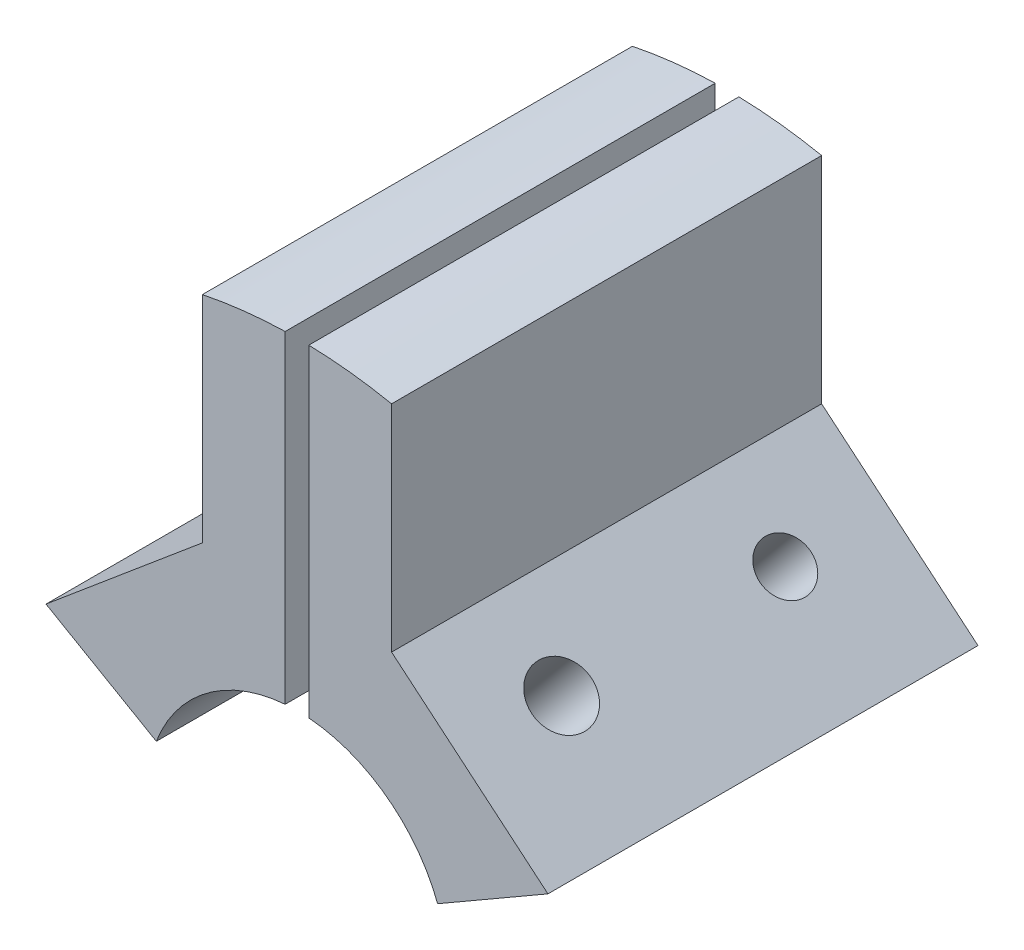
from build123d import *

# Parameters (mm, degrees)
SKETCH_1_W          = 2.75
SKETCH_1_H          = 28.136911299
EXTRUDE_1_DEPTH     = 25
SKETCH_2_W          = 2.75
SKETCH_2_H          = 4.7
CUT_EXTRUDE_1_DEPTH = 59.454793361
SKETCH_5_R          = 3
SKETCH_5_R_2        = 3.5
CUT_EXTRUDE_2_DEPTH = 64.148156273
SKETCH_6_R          = 3
SKETCH_6_R_2        = 3.5
CUT_EXTRUDE_3_DEPTH = 64.148156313


with BuildPart() as part:
    # Sketch 1 → Extrude 1 (new, symmetric)
    with BuildSketch(Plane.XY):
        with BuildLine():
            ThreePointArc((-1.375, 54.982809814), (-6.21163301, 54.648107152), (-11, 53.888774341))
            Line((-11, 53.888774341), (-11, 28.888774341))
            Line((-11, 28.888774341), (-29.178360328, 13.635318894))
            Line((-29.178360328, 13.635318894), (-16.353227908, 6.230725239))
            ThreePointArc((-16.353227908, 6.230725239), (-10.48892483, 14.008299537), (-1.375, 17.445898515))
            Line((-1.375, 17.445898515), (-1.375, 22.145898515))
            Line((-1.375, 22.145898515), (-1.375, 50.282809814))
            Line((-1.375, 50.282809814), (-1.375, 54.982809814))
        make_face()
        with BuildLine():
            ThreePointArc((11, 53.888774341), (6.21163301, 54.648107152), (1.375, 54.982809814))
            Line((1.375, 54.982809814), (1.375, 50.282809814))
            Line((1.375, 50.282809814), (1.375, 22.145898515))
            Line((1.375, 22.145898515), (1.375, 17.445898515))
            ThreePointArc((1.375, 17.445898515), (10.48892483, 14.008299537), (16.353227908, 6.230725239))
            Line((16.353227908, 6.230725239), (29.178360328, 13.635318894))
            Line((29.178360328, 13.635318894), (11, 28.888774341))
            Line((11, 28.888774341), (11, 53.888774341))
        make_face()
        with Locations((0, 36.214354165)):
            Rectangle(SKETCH_1_W, SKETCH_1_H)
    extrude(amount=EXTRUDE_1_DEPTH, both=True)

    # Sketch 2 → Cut-Extrude 1 (cut, through all)
    with BuildSketch(Plane(origin=(0, 50.282809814, 0), x_dir=(1, 0, 0), z_dir=(0, 1, 0))):
        with Locations((0, 22.65)):
            Rectangle(SKETCH_2_W, SKETCH_2_H)
        with Locations((0, -22.65)):
            Rectangle(SKETCH_2_W, SKETCH_2_H)
    extrude(amount=-CUT_EXTRUDE_1_DEPTH, mode=Mode.SUBTRACT)

    # Sketch 5 → Cut-Extrude 2 (cut, through all)
    with BuildSketch(Plane(origin=(-18.769879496, 22.369071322, 0), x_dir=(0.7660444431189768, 0.642787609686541, 0), z_dir=(-0.642787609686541, 0.7660444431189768, 0))):
        with Locations(Location((0, -13, 0), (0, 0, 180))):
            Circle(SKETCH_5_R)
        with Locations(Location((0, 13, 0), (0, 0, 180))):
            Circle(SKETCH_5_R_2)
    extrude(amount=-CUT_EXTRUDE_2_DEPTH, mode=Mode.SUBTRACT)

    # Sketch 6 → Cut-Extrude 3 (cut, through all)
    with BuildSketch(Plane(origin=(18.769879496, 22.369071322, 0), x_dir=(0.7660444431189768, -0.642787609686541, 0), z_dir=(0.642787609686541, 0.7660444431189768, 0))):
        with Locations(Location((0, 13, 0), (0, 0, 180))):
            Circle(SKETCH_6_R)
        with Locations(Location((0, -13, 0), (0, 0, 180))):
            Circle(SKETCH_6_R_2)
    extrude(amount=-CUT_EXTRUDE_3_DEPTH, mode=Mode.SUBTRACT)


solid = part.part
